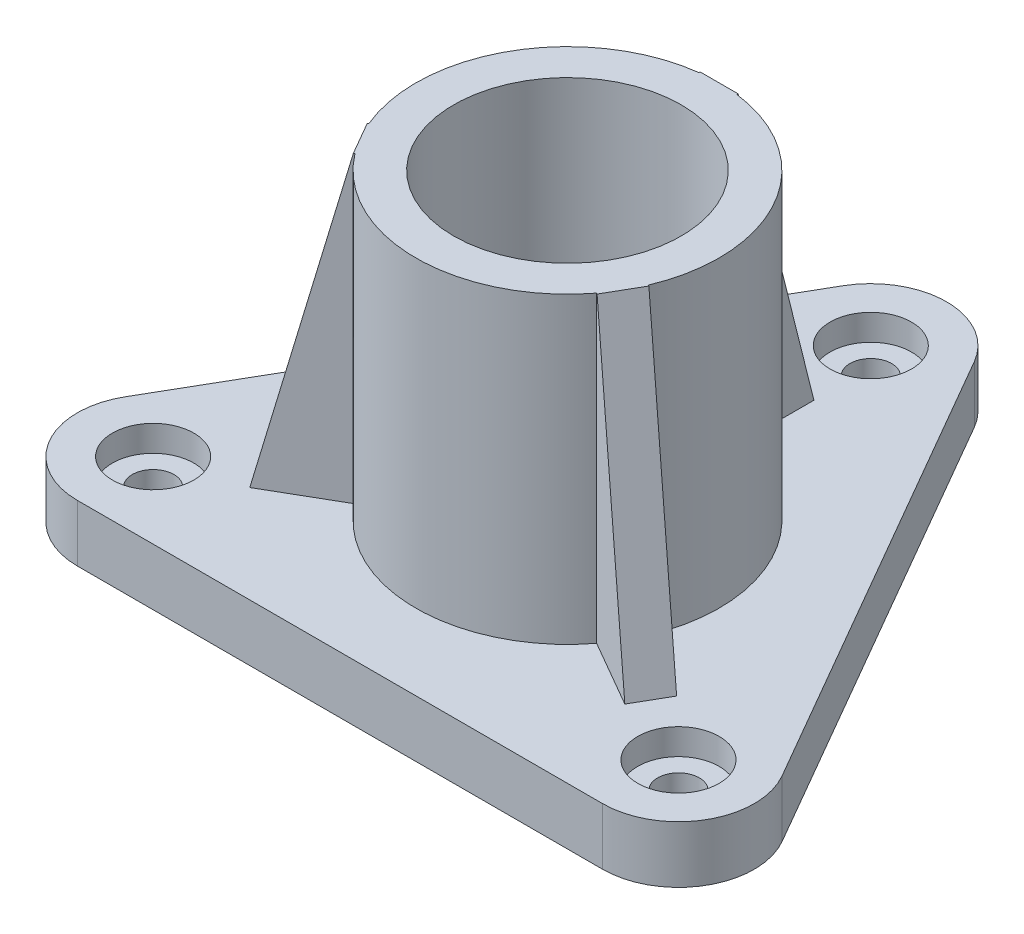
ISO-10303-21;
HEADER;
FILE_DESCRIPTION(('STEP AP214'),'2;1');
FILE_NAME('part.step','',(''),(''),'','','');
FILE_SCHEMA(('AUTOMOTIVE_DESIGN { 1 0 10303 214 1 1 1 1 }'));
ENDSEC;
DATA;
#1=APPLICATION_CONTEXT('core data for automotive mechanical design processes');
#2=APPLICATION_PROTOCOL_DEFINITION('international standard','automotive_design',2000,#1);
#3=PRODUCT_CONTEXT('',#1,'mechanical');
#4=PRODUCT('Part','Part','',(#3));
#5=PRODUCT_RELATED_PRODUCT_CATEGORY('part','',(#4));
#6=PRODUCT_DEFINITION_FORMATION('','',#4);
#7=PRODUCT_DEFINITION_CONTEXT('part definition',#1,'design');
#8=PRODUCT_DEFINITION('design','',#6,#7);
#9=PRODUCT_DEFINITION_SHAPE('','',#8);
#10=(LENGTH_UNIT() NAMED_UNIT(*) SI_UNIT(.MILLI.,.METRE.));
#11=(NAMED_UNIT(*) PLANE_ANGLE_UNIT() SI_UNIT($,.RADIAN.));
#12=(NAMED_UNIT(*) SI_UNIT($,.STERADIAN.) SOLID_ANGLE_UNIT());
#13=UNCERTAINTY_MEASURE_WITH_UNIT(LENGTH_MEASURE(1.E-05),#10,'distance_accuracy_value','');
#14=(GEOMETRIC_REPRESENTATION_CONTEXT(3) GLOBAL_UNCERTAINTY_ASSIGNED_CONTEXT((#13)) GLOBAL_UNIT_ASSIGNED_CONTEXT((#10,
#11,#12)) REPRESENTATION_CONTEXT('',''));
#15=CARTESIAN_POINT('',(0.,0.,0.));
#16=DIRECTION('',(0.,0.,1.));
#17=DIRECTION('',(1.,0.,0.));
#18=AXIS2_PLACEMENT_3D('',#15,#16,#17);
#19=CARTESIAN_POINT('',(0.,95.,0.));
#20=DIRECTION('',(0.,-1.,0.));
#21=DIRECTION('',(0.,0.,-1.));
#22=AXIS2_PLACEMENT_3D('',#19,#20,#21);
#23=CYLINDRICAL_SURFACE('',#22,40.);
#24=DIRECTION('',(0.,-1.,0.));
#25=VECTOR('',#24,1.);
#26=CARTESIAN_POINT('',(-31.869317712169,95.,24.1732618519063));
#27=LINE('',#26,#25);
#28=CARTESIAN_POINT('',(-31.869317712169,15.,24.1732618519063));
#29=VERTEX_POINT('',#28);
#30=CARTESIAN_POINT('',(-31.869317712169,95.,24.1732618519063));
#31=VERTEX_POINT('',#30);
#32=EDGE_CURVE('E41',#29,#31,#27,.F.);
#33=ORIENTED_EDGE('',*,*,#32,.F.);
#34=CARTESIAN_POINT('',(0.,15.,0.));
#35=DIRECTION('',(0.,-1.,0.));
#36=DIRECTION('',(0.,0.,-1.));
#37=AXIS2_PLACEMENT_3D('',#34,#35,#36);
#38=CIRCLE('',#37,40.);
#39=CARTESIAN_POINT('',(31.8693177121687,15.,24.1732618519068));
#40=VERTEX_POINT('',#39);
#41=EDGE_CURVE('E322',#29,#40,#38,.F.);
#42=ORIENTED_EDGE('',*,*,#41,.T.);
#43=DIRECTION('',(0.,-1.,0.));
#44=VECTOR('',#43,1.);
#45=CARTESIAN_POINT('',(31.8693177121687,95.,24.1732618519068));
#46=LINE('',#45,#44);
#47=CARTESIAN_POINT('',(31.8693177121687,95.,24.1732618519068));
#48=VERTEX_POINT('',#47);
#49=EDGE_CURVE('E331',#40,#48,#46,.F.);
#50=ORIENTED_EDGE('',*,*,#49,.T.);
#51=CARTESIAN_POINT('',(0.,95.,0.));
#52=DIRECTION('',(0.,1.,0.));
#53=DIRECTION('',(0.,0.,1.));
#54=AXIS2_PLACEMENT_3D('',#51,#52,#53);
#55=CIRCLE('',#54,40.);
#56=EDGE_CURVE('E270',#31,#48,#55,.T.);
#57=ORIENTED_EDGE('',*,*,#56,.F.);
#58=EDGE_LOOP('',(#33,#42,#50,#57));
#59=FACE_BOUND('',#58,.T.);
#60=ADVANCED_FACE('F33',(#59),#23,.T.);
#61=DIRECTION('',(0.,-1.,0.));
#62=VECTOR('',#61,1.);
#63=CARTESIAN_POINT('',(36.8693177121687,95.,15.5130078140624));
#64=LINE('',#63,#62);
#65=CARTESIAN_POINT('',(36.8693177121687,15.,15.5130078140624));
#66=VERTEX_POINT('',#65);
#67=CARTESIAN_POINT('',(36.8693177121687,95.,15.5130078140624));
#68=VERTEX_POINT('',#67);
#69=EDGE_CURVE('E328',#66,#68,#64,.F.);
#70=ORIENTED_EDGE('',*,*,#69,.F.);
#71=CARTESIAN_POINT('',(5.,15.,-39.6862696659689));
#72=VERTEX_POINT('',#71);
#73=EDGE_CURVE('E317',#66,#72,#38,.F.);
#74=ORIENTED_EDGE('',*,*,#73,.T.);
#75=DIRECTION('',(0.,-1.,0.));
#76=VECTOR('',#75,1.);
#77=CARTESIAN_POINT('',(5.,95.,-39.6862696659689));
#78=LINE('',#77,#76);
#79=CARTESIAN_POINT('',(5.,95.,-39.6862696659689));
#80=VERTEX_POINT('',#79);
#81=EDGE_CURVE('E325',#72,#80,#78,.F.);
#82=ORIENTED_EDGE('',*,*,#81,.T.);
#83=EDGE_CURVE('E266',#68,#80,#55,.T.);
#84=ORIENTED_EDGE('',*,*,#83,.F.);
#85=EDGE_LOOP('',(#70,#74,#82,#84));
#86=FACE_BOUND('',#85,.T.);
#87=ADVANCED_FACE('F344',(#86),#23,.T.);
#88=CARTESIAN_POINT('',(-69.2820323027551,15.,40.));
#89=DIRECTION('',(0.,-1.,0.));
#90=DIRECTION('',(0.,0.,-1.));
#91=AXIS2_PLACEMENT_3D('',#88,#89,#90);
#92=PLANE('',#91);
#93=CARTESIAN_POINT('',(-69.2820323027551,15.,40.));
#94=DIRECTION('',(0.,1.,0.));
#95=DIRECTION('',(0.,0.,1.));
#96=AXIS2_PLACEMENT_3D('',#93,#94,#95);
#97=CIRCLE('',#96,10.74);
#98=CARTESIAN_POINT('',(-69.2820323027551,15.,50.74));
#99=VERTEX_POINT('',#98);
#100=EDGE_CURVE('E227',#99,#99,#97,.T.);
#101=ORIENTED_EDGE('',*,*,#100,.F.);
#102=EDGE_LOOP('',(#101));
#103=FACE_BOUND('',#102,.T.);
#104=CARTESIAN_POINT('',(0.,15.,-80.));
#105=DIRECTION('',(0.,1.,0.));
#106=DIRECTION('',(0.,0.,1.));
#107=AXIS2_PLACEMENT_3D('',#104,#105,#106);
#108=CIRCLE('',#107,10.74);
#109=CARTESIAN_POINT('',(0.,15.,-69.26));
#110=VERTEX_POINT('',#109);
#111=EDGE_CURVE('E239',#110,#110,#108,.T.);
#112=ORIENTED_EDGE('',*,*,#111,.F.);
#113=EDGE_LOOP('',(#112));
#114=FACE_BOUND('',#113,.T.);
#115=CARTESIAN_POINT('',(69.2820323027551,15.,40.));
#116=DIRECTION('',(0.,1.,0.));
#117=DIRECTION('',(0.,0.,1.));
#118=AXIS2_PLACEMENT_3D('',#115,#116,#117);
#119=CIRCLE('',#118,10.74);
#120=CARTESIAN_POINT('',(69.2820323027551,15.,50.74));
#121=VERTEX_POINT('',#120);
#122=EDGE_CURVE('E251',#121,#121,#119,.T.);
#123=ORIENTED_EDGE('',*,*,#122,.F.);
#124=EDGE_LOOP('',(#123));
#125=FACE_BOUND('',#124,.T.);
#126=CARTESIAN_POINT('',(-69.2820323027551,15.,40.));
#127=DIRECTION('',(0.,1.,0.));
#128=DIRECTION('',(0.,0.,-1.));
#129=AXIS2_PLACEMENT_3D('',#126,#127,#128);
#130=CIRCLE('',#129,20.);
#131=CARTESIAN_POINT('',(-86.6025403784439,15.,30.));
#132=VERTEX_POINT('',#131);
#133=CARTESIAN_POINT('',(-69.2820323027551,15.,60.0000000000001));
#134=VERTEX_POINT('',#133);
#135=EDGE_CURVE('E286',#132,#134,#130,.T.);
#136=ORIENTED_EDGE('',*,*,#135,.T.);
#137=DIRECTION('',(1.,0.,0.));
#138=VECTOR('',#137,1.);
#139=CARTESIAN_POINT('',(-69.2820323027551,15.,60.0000000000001));
#140=LINE('',#139,#138);
#141=CARTESIAN_POINT('',(69.2820323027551,15.,60.));
#142=VERTEX_POINT('',#141);
#143=EDGE_CURVE('E289',#134,#142,#140,.T.);
#144=ORIENTED_EDGE('',*,*,#143,.T.);
#145=CARTESIAN_POINT('',(69.2820323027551,15.,40.));
#146=DIRECTION('',(0.,1.,0.));
#147=DIRECTION('',(0.,0.,-1.));
#148=AXIS2_PLACEMENT_3D('',#145,#146,#147);
#149=CIRCLE('',#148,20.);
#150=CARTESIAN_POINT('',(86.6025403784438,15.,30.));
#151=VERTEX_POINT('',#150);
#152=EDGE_CURVE('E291',#142,#151,#149,.T.);
#153=ORIENTED_EDGE('',*,*,#152,.T.);
#154=DIRECTION('',(-0.5,0.,-0.866025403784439));
#155=VECTOR('',#154,1.);
#156=CARTESIAN_POINT('',(86.6025403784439,15.,30.));
#157=LINE('',#156,#155);
#158=CARTESIAN_POINT('',(17.3205080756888,15.,-90.));
#159=VERTEX_POINT('',#158);
#160=EDGE_CURVE('E293',#151,#159,#157,.T.);
#161=ORIENTED_EDGE('',*,*,#160,.T.);
#162=CARTESIAN_POINT('',(0.,15.,-80.));
#163=DIRECTION('',(0.,1.,0.));
#164=DIRECTION('',(0.,0.,1.));
#165=AXIS2_PLACEMENT_3D('',#162,#163,#164);
#166=CIRCLE('',#165,20.);
#167=CARTESIAN_POINT('',(-17.3205080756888,15.,-90.));
#168=VERTEX_POINT('',#167);
#169=EDGE_CURVE('E295',#159,#168,#166,.T.);
#170=ORIENTED_EDGE('',*,*,#169,.T.);
#171=DIRECTION('',(-0.5,0.,0.866025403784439));
#172=VECTOR('',#171,1.);
#173=CARTESIAN_POINT('',(-17.3205080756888,15.,-90.));
#174=LINE('',#173,#172);
#175=EDGE_CURVE('E297',#168,#132,#174,.T.);
#176=ORIENTED_EDGE('',*,*,#175,.T.);
#177=EDGE_LOOP('',(#136,#144,#153,#161,#170,#176));
#178=FACE_BOUND('',#177,.T.);
#179=DIRECTION('',(0.499999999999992,0.,0.866025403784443));
#180=VECTOR('',#179,1.);
#181=CARTESIAN_POINT('',(-54.4615242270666,15.,25.6698729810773));
#182=LINE('',#181,#180);
#183=CARTESIAN_POINT('',(-54.4615242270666,15.,25.6698729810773));
#184=VERTEX_POINT('',#183);
#185=CARTESIAN_POINT('',(-49.4615242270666,15.,34.3301270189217));
#186=VERTEX_POINT('',#185);
#187=EDGE_CURVE('E48',#184,#186,#182,.T.);
#188=ORIENTED_EDGE('',*,*,#187,.F.);
#189=DIRECTION('',(-0.866025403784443,0.,0.499999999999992));
#190=VECTOR('',#189,1.);
#191=CARTESIAN_POINT('',(-28.4807621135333,15.,10.6698729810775));
#192=LINE('',#191,#190);
#193=CARTESIAN_POINT('',(-36.869317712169,15.,15.5130078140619));
#194=VERTEX_POINT('',#193);
#195=EDGE_CURVE('E180',#194,#184,#192,.T.);
#196=ORIENTED_EDGE('',*,*,#195,.F.);
#197=CARTESIAN_POINT('',(-5.,15.,-39.6862696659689));
#198=VERTEX_POINT('',#197);
#199=EDGE_CURVE('E318',#198,#194,#38,.F.);
#200=ORIENTED_EDGE('',*,*,#199,.F.);
#201=DIRECTION('',(0.,0.,-1.));
#202=VECTOR('',#201,1.);
#203=CARTESIAN_POINT('',(-5.,15.,-30.));
#204=LINE('',#203,#202);
#205=CARTESIAN_POINT('',(-5.,15.,-60.));
#206=VERTEX_POINT('',#205);
#207=EDGE_CURVE('E209',#198,#206,#204,.T.);
#208=ORIENTED_EDGE('',*,*,#207,.T.);
#209=DIRECTION('',(-1.,0.,0.));
#210=VECTOR('',#209,1.);
#211=CARTESIAN_POINT('',(5.,15.,-60.));
#212=LINE('',#211,#210);
#213=CARTESIAN_POINT('',(5.,15.,-60.));
#214=VERTEX_POINT('',#213);
#215=EDGE_CURVE('E224',#214,#206,#212,.T.);
#216=ORIENTED_EDGE('',*,*,#215,.F.);
#217=DIRECTION('',(0.,0.,-1.));
#218=VECTOR('',#217,1.);
#219=CARTESIAN_POINT('',(5.,15.,-30.));
#220=LINE('',#219,#218);
#221=EDGE_CURVE('E217',#72,#214,#220,.T.);
#222=ORIENTED_EDGE('',*,*,#221,.F.);
#223=ORIENTED_EDGE('',*,*,#73,.F.);
#224=DIRECTION('',(0.866025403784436,0.,0.500000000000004));
#225=VECTOR('',#224,1.);
#226=CARTESIAN_POINT('',(28.4807621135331,15.,10.6698729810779));
#227=LINE('',#226,#225);
#228=CARTESIAN_POINT('',(54.4615242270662,15.,25.6698729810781));
#229=VERTEX_POINT('',#228);
#230=EDGE_CURVE('E187',#66,#229,#227,.T.);
#231=ORIENTED_EDGE('',*,*,#230,.T.);
#232=DIRECTION('',(0.500000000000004,0.,-0.866025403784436));
#233=VECTOR('',#232,1.);
#234=CARTESIAN_POINT('',(49.4615242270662,15.,34.3301270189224));
#235=LINE('',#234,#233);
#236=CARTESIAN_POINT('',(49.4615242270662,15.,34.3301270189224));
#237=VERTEX_POINT('',#236);
#238=EDGE_CURVE('E203',#237,#229,#235,.T.);
#239=ORIENTED_EDGE('',*,*,#238,.F.);
#240=DIRECTION('',(0.866025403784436,0.,0.500000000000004));
#241=VECTOR('',#240,1.);
#242=CARTESIAN_POINT('',(23.4807621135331,15.,19.3301270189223));
#243=LINE('',#242,#241);
#244=EDGE_CURVE('E195',#40,#237,#243,.T.);
#245=ORIENTED_EDGE('',*,*,#244,.F.);
#246=ORIENTED_EDGE('',*,*,#41,.F.);
#247=DIRECTION('',(-0.866025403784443,0.,0.499999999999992));
#248=VECTOR('',#247,1.);
#249=CARTESIAN_POINT('',(-23.4807621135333,15.,19.330127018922));
#250=LINE('',#249,#248);
#251=EDGE_CURVE('E53',#29,#186,#250,.T.);
#252=ORIENTED_EDGE('',*,*,#251,.T.);
#253=EDGE_LOOP('',(#188,#196,#200,#208,#216,#222,#223,#231,#239,#245,#246,#252));
#254=FACE_BOUND('',#253,.T.);
#255=ADVANCED_FACE('F362',(#103,#114,#125,#178,#254),#92,.F.);
#256=CARTESIAN_POINT('',(-69.2820323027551,0.,40.));
#257=DIRECTION('',(0.,-1.,0.));
#258=DIRECTION('',(0.,0.,-1.));
#259=AXIS2_PLACEMENT_3D('',#256,#257,#258);
#260=PLANE('',#259);
#261=CARTESIAN_POINT('',(-69.2820323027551,0.,40.));
#262=DIRECTION('',(0.,1.,0.));
#263=DIRECTION('',(0.,0.,1.));
#264=AXIS2_PLACEMENT_3D('',#261,#262,#263);
#265=CIRCLE('',#264,5.49999999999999);
#266=CARTESIAN_POINT('',(-69.2820323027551,0.,45.5));
#267=VERTEX_POINT('',#266);
#268=EDGE_CURVE('E236',#267,#267,#265,.T.);
#269=ORIENTED_EDGE('',*,*,#268,.T.);
#270=EDGE_LOOP('',(#269));
#271=FACE_BOUND('',#270,.T.);
#272=CARTESIAN_POINT('',(0.,0.,-80.));
#273=DIRECTION('',(0.,1.,0.));
#274=DIRECTION('',(0.,0.,1.));
#275=AXIS2_PLACEMENT_3D('',#272,#273,#274);
#276=CIRCLE('',#275,5.5);
#277=CARTESIAN_POINT('',(0.,0.,-74.5));
#278=VERTEX_POINT('',#277);
#279=EDGE_CURVE('E248',#278,#278,#276,.T.);
#280=ORIENTED_EDGE('',*,*,#279,.T.);
#281=EDGE_LOOP('',(#280));
#282=FACE_BOUND('',#281,.T.);
#283=CARTESIAN_POINT('',(69.2820323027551,0.,40.));
#284=DIRECTION('',(0.,1.,0.));
#285=DIRECTION('',(0.,0.,1.));
#286=AXIS2_PLACEMENT_3D('',#283,#284,#285);
#287=CIRCLE('',#286,5.49999999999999);
#288=CARTESIAN_POINT('',(69.2820323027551,0.,45.5));
#289=VERTEX_POINT('',#288);
#290=EDGE_CURVE('E260',#289,#289,#287,.T.);
#291=ORIENTED_EDGE('',*,*,#290,.T.);
#292=EDGE_LOOP('',(#291));
#293=FACE_BOUND('',#292,.T.);
#294=CARTESIAN_POINT('',(-69.2820323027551,0.,40.));
#295=DIRECTION('',(0.,1.,0.));
#296=DIRECTION('',(0.,0.,-1.));
#297=AXIS2_PLACEMENT_3D('',#294,#295,#296);
#298=CIRCLE('',#297,20.);
#299=CARTESIAN_POINT('',(-86.6025403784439,0.,30.));
#300=VERTEX_POINT('',#299);
#301=CARTESIAN_POINT('',(-69.2820323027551,0.,60.0000000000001));
#302=VERTEX_POINT('',#301);
#303=EDGE_CURVE('E273',#300,#302,#298,.T.);
#304=ORIENTED_EDGE('',*,*,#303,.F.);
#305=DIRECTION('',(-0.5,0.,0.866025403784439));
#306=VECTOR('',#305,1.);
#307=CARTESIAN_POINT('',(-17.3205080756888,0.,-90.));
#308=LINE('',#307,#306);
#309=CARTESIAN_POINT('',(-17.3205080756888,0.,-90.));
#310=VERTEX_POINT('',#309);
#311=EDGE_CURVE('E284',#310,#300,#308,.T.);
#312=ORIENTED_EDGE('',*,*,#311,.F.);
#313=CARTESIAN_POINT('',(0.,0.,-80.));
#314=DIRECTION('',(0.,1.,0.));
#315=DIRECTION('',(0.,0.,1.));
#316=AXIS2_PLACEMENT_3D('',#313,#314,#315);
#317=CIRCLE('',#316,20.);
#318=CARTESIAN_POINT('',(17.3205080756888,0.,-90.));
#319=VERTEX_POINT('',#318);
#320=EDGE_CURVE('E282',#319,#310,#317,.T.);
#321=ORIENTED_EDGE('',*,*,#320,.F.);
#322=DIRECTION('',(-0.5,0.,-0.866025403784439));
#323=VECTOR('',#322,1.);
#324=CARTESIAN_POINT('',(86.6025403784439,0.,30.));
#325=LINE('',#324,#323);
#326=CARTESIAN_POINT('',(86.6025403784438,0.,30.));
#327=VERTEX_POINT('',#326);
#328=EDGE_CURVE('E280',#327,#319,#325,.T.);
#329=ORIENTED_EDGE('',*,*,#328,.F.);
#330=CARTESIAN_POINT('',(69.2820323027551,0.,40.));
#331=DIRECTION('',(0.,1.,0.));
#332=DIRECTION('',(0.,0.,-1.));
#333=AXIS2_PLACEMENT_3D('',#330,#331,#332);
#334=CIRCLE('',#333,20.);
#335=CARTESIAN_POINT('',(69.2820323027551,0.,60.));
#336=VERTEX_POINT('',#335);
#337=EDGE_CURVE('E278',#336,#327,#334,.T.);
#338=ORIENTED_EDGE('',*,*,#337,.F.);
#339=DIRECTION('',(1.,0.,0.));
#340=VECTOR('',#339,1.);
#341=CARTESIAN_POINT('',(-69.2820323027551,0.,60.0000000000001));
#342=LINE('',#341,#340);
#343=EDGE_CURVE('E276',#302,#336,#342,.T.);
#344=ORIENTED_EDGE('',*,*,#343,.F.);
#345=EDGE_LOOP('',(#304,#312,#321,#329,#338,#344));
#346=FACE_BOUND('',#345,.T.);
#347=CARTESIAN_POINT('',(0.,0.,0.));
#348=DIRECTION('',(0.,1.,0.));
#349=DIRECTION('',(0.,0.,1.));
#350=AXIS2_PLACEMENT_3D('',#347,#348,#349);
#351=CIRCLE('',#350,30.);
#352=CARTESIAN_POINT('',(0.,0.,30.));
#353=VERTEX_POINT('',#352);
#354=EDGE_CURVE('E269',#353,#353,#351,.T.);
#355=ORIENTED_EDGE('',*,*,#354,.T.);
#356=EDGE_LOOP('',(#355));
#357=FACE_BOUND('',#356,.T.);
#358=ADVANCED_FACE('F501',(#271,#282,#293,#346,#357),#260,.T.);
#359=CARTESIAN_POINT('',(-69.2820323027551,15.,40.));
#360=DIRECTION('',(0.,-1.,0.));
#361=DIRECTION('',(0.,0.,-1.));
#362=AXIS2_PLACEMENT_3D('',#359,#360,#361);
#363=CYLINDRICAL_SURFACE('',#362,20.);
#364=ORIENTED_EDGE('',*,*,#303,.T.);
#365=DIRECTION('',(0.,-1.,0.));
#366=VECTOR('',#365,1.);
#367=CARTESIAN_POINT('',(-69.2820323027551,15.,60.0000000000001));
#368=LINE('',#367,#366);
#369=EDGE_CURVE('E314',#134,#302,#368,.T.);
#370=ORIENTED_EDGE('',*,*,#369,.F.);
#371=ORIENTED_EDGE('',*,*,#135,.F.);
#372=DIRECTION('',(0.,-1.,0.));
#373=VECTOR('',#372,1.);
#374=CARTESIAN_POINT('',(-86.6025403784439,15.,30.));
#375=LINE('',#374,#373);
#376=EDGE_CURVE('E299',#132,#300,#375,.T.);
#377=ORIENTED_EDGE('',*,*,#376,.T.);
#378=EDGE_LOOP('',(#364,#370,#371,#377));
#379=FACE_BOUND('',#378,.T.);
#380=ADVANCED_FACE('F35',(#379),#363,.T.);
#381=CARTESIAN_POINT('',(-69.2820323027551,15.,60.0000000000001));
#382=DIRECTION('',(0.,0.,-1.));
#383=DIRECTION('',(-1.,0.,0.));
#384=AXIS2_PLACEMENT_3D('',#381,#382,#383);
#385=PLANE('',#384);
#386=ORIENTED_EDGE('',*,*,#343,.T.);
#387=DIRECTION('',(0.,-1.,0.));
#388=VECTOR('',#387,1.);
#389=CARTESIAN_POINT('',(69.2820323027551,15.,60.));
#390=LINE('',#389,#388);
#391=EDGE_CURVE('E311',#142,#336,#390,.T.);
#392=ORIENTED_EDGE('',*,*,#391,.F.);
#393=ORIENTED_EDGE('',*,*,#143,.F.);
#394=ORIENTED_EDGE('',*,*,#369,.T.);
#395=EDGE_LOOP('',(#386,#392,#393,#394));
#396=FACE_BOUND('',#395,.T.);
#397=ADVANCED_FACE('F631',(#396),#385,.F.);
#398=CARTESIAN_POINT('',(69.2820323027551,15.,40.));
#399=DIRECTION('',(0.,-1.,0.));
#400=DIRECTION('',(0.,0.,-1.));
#401=AXIS2_PLACEMENT_3D('',#398,#399,#400);
#402=CYLINDRICAL_SURFACE('',#401,20.);
#403=ORIENTED_EDGE('',*,*,#337,.T.);
#404=DIRECTION('',(0.,-1.,0.));
#405=VECTOR('',#404,1.);
#406=CARTESIAN_POINT('',(86.6025403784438,15.,30.));
#407=LINE('',#406,#405);
#408=EDGE_CURVE('E308',#151,#327,#407,.T.);
#409=ORIENTED_EDGE('',*,*,#408,.F.);
#410=ORIENTED_EDGE('',*,*,#152,.F.);
#411=ORIENTED_EDGE('',*,*,#391,.T.);
#412=EDGE_LOOP('',(#403,#409,#410,#411));
#413=FACE_BOUND('',#412,.T.);
#414=ADVANCED_FACE('F621',(#413),#402,.T.);
#415=CARTESIAN_POINT('',(86.6025403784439,15.,30.));
#416=DIRECTION('',(-0.866025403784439,0.,0.5));
#417=DIRECTION('',(0.5,0.,0.866025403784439));
#418=AXIS2_PLACEMENT_3D('',#415,#416,#417);
#419=PLANE('',#418);
#420=ORIENTED_EDGE('',*,*,#328,.T.);
#421=DIRECTION('',(0.,-1.,0.));
#422=VECTOR('',#421,1.);
#423=CARTESIAN_POINT('',(17.3205080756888,15.,-90.));
#424=LINE('',#423,#422);
#425=EDGE_CURVE('E305',#159,#319,#424,.T.);
#426=ORIENTED_EDGE('',*,*,#425,.F.);
#427=ORIENTED_EDGE('',*,*,#160,.F.);
#428=ORIENTED_EDGE('',*,*,#408,.T.);
#429=EDGE_LOOP('',(#420,#426,#427,#428));
#430=FACE_BOUND('',#429,.T.);
#431=ADVANCED_FACE('F611',(#430),#419,.F.);
#432=CARTESIAN_POINT('',(0.,15.,-80.));
#433=DIRECTION('',(0.,-1.,0.));
#434=DIRECTION('',(0.,0.,-1.));
#435=AXIS2_PLACEMENT_3D('',#432,#433,#434);
#436=CYLINDRICAL_SURFACE('',#435,20.);
#437=ORIENTED_EDGE('',*,*,#320,.T.);
#438=DIRECTION('',(0.,-1.,0.));
#439=VECTOR('',#438,1.);
#440=CARTESIAN_POINT('',(-17.3205080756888,15.,-90.));
#441=LINE('',#440,#439);
#442=EDGE_CURVE('E302',#168,#310,#441,.T.);
#443=ORIENTED_EDGE('',*,*,#442,.F.);
#444=ORIENTED_EDGE('',*,*,#169,.F.);
#445=ORIENTED_EDGE('',*,*,#425,.T.);
#446=EDGE_LOOP('',(#437,#443,#444,#445));
#447=FACE_BOUND('',#446,.T.);
#448=ADVANCED_FACE('F601',(#447),#436,.T.);
#449=CARTESIAN_POINT('',(-17.3205080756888,15.,-90.));
#450=DIRECTION('',(0.866025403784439,0.,0.5));
#451=DIRECTION('',(0.5,0.,-0.866025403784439));
#452=AXIS2_PLACEMENT_3D('',#449,#450,#451);
#453=PLANE('',#452);
#454=ORIENTED_EDGE('',*,*,#311,.T.);
#455=ORIENTED_EDGE('',*,*,#376,.F.);
#456=ORIENTED_EDGE('',*,*,#175,.F.);
#457=ORIENTED_EDGE('',*,*,#442,.T.);
#458=EDGE_LOOP('',(#454,#455,#456,#457));
#459=FACE_BOUND('',#458,.T.);
#460=ADVANCED_FACE('F398',(#459),#453,.F.);
#461=CARTESIAN_POINT('',(0.,15.,0.));
#462=DIRECTION('',(0.,-1.,0.));
#463=DIRECTION('',(0.,0.,-1.));
#464=AXIS2_PLACEMENT_3D('',#461,#462,#463);
#465=CYLINDRICAL_SURFACE('',#464,30.);
#466=ORIENTED_EDGE('',*,*,#354,.F.);
#467=EDGE_LOOP('',(#466));
#468=FACE_BOUND('',#467,.T.);
#469=CARTESIAN_POINT('',(0.,95.,0.));
#470=DIRECTION('',(0.,1.,0.));
#471=DIRECTION('',(0.,0.,1.));
#472=AXIS2_PLACEMENT_3D('',#469,#470,#471);
#473=CIRCLE('',#472,30.);
#474=CARTESIAN_POINT('',(0.,95.,30.));
#475=VERTEX_POINT('',#474);
#476=EDGE_CURVE('E263',#475,#475,#473,.T.);
#477=ORIENTED_EDGE('',*,*,#476,.T.);
#478=EDGE_LOOP('',(#477));
#479=FACE_BOUND('',#478,.T.);
#480=ADVANCED_FACE('F393',(#468,#479),#465,.F.);
#481=CARTESIAN_POINT('',(0.,95.,0.));
#482=DIRECTION('',(0.,1.,0.));
#483=DIRECTION('',(0.,0.,1.));
#484=AXIS2_PLACEMENT_3D('',#481,#482,#483);
#485=PLANE('',#484);
#486=ORIENTED_EDGE('',*,*,#476,.F.);
#487=EDGE_LOOP('',(#486));
#488=FACE_BOUND('',#487,.T.);
#489=CARTESIAN_POINT('',(-5.,95.,-39.6862696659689));
#490=VERTEX_POINT('',#489);
#491=CARTESIAN_POINT('',(-36.869317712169,95.,15.5130078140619));
#492=VERTEX_POINT('',#491);
#493=EDGE_CURVE('E267',#490,#492,#55,.T.);
#494=ORIENTED_EDGE('',*,*,#493,.T.);
#495=DIRECTION('',(0.866025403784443,0.,-0.499999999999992));
#496=VECTOR('',#495,1.);
#497=CARTESIAN_POINT('',(-37.1410161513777,95.,15.6698729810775));
#498=LINE('',#497,#496);
#499=CARTESIAN_POINT('',(-37.1410161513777,95.,15.6698729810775));
#500=VERTEX_POINT('',#499);
#501=EDGE_CURVE('E163',#500,#492,#498,.T.);
#502=ORIENTED_EDGE('',*,*,#501,.F.);
#503=DIRECTION('',(0.499999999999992,0.,0.866025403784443));
#504=VECTOR('',#503,1.);
#505=CARTESIAN_POINT('',(-37.1410161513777,95.,15.6698729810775));
#506=LINE('',#505,#504);
#507=CARTESIAN_POINT('',(-32.1410161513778,95.,24.3301270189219));
#508=VERTEX_POINT('',#507);
#509=EDGE_CURVE('E156',#500,#508,#506,.T.);
#510=ORIENTED_EDGE('',*,*,#509,.T.);
#511=DIRECTION('',(0.866025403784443,0.,-0.499999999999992));
#512=VECTOR('',#511,1.);
#513=CARTESIAN_POINT('',(-32.1410161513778,95.,24.3301270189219));
#514=LINE('',#513,#512);
#515=EDGE_CURVE('E161',#508,#31,#514,.T.);
#516=ORIENTED_EDGE('',*,*,#515,.T.);
#517=ORIENTED_EDGE('',*,*,#56,.T.);
#518=DIRECTION('',(-0.866025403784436,0.,-0.500000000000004));
#519=VECTOR('',#518,1.);
#520=CARTESIAN_POINT('',(32.1410161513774,95.,24.3301270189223));
#521=LINE('',#520,#519);
#522=CARTESIAN_POINT('',(32.1410161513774,95.,24.3301270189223));
#523=VERTEX_POINT('',#522);
#524=EDGE_CURVE('E192',#523,#48,#521,.T.);
#525=ORIENTED_EDGE('',*,*,#524,.F.);
#526=DIRECTION('',(0.500000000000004,0.,-0.866025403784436));
#527=VECTOR('',#526,1.);
#528=CARTESIAN_POINT('',(32.1410161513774,95.,24.3301270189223));
#529=LINE('',#528,#527);
#530=CARTESIAN_POINT('',(37.1410161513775,95.,15.669872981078));
#531=VERTEX_POINT('',#530);
#532=EDGE_CURVE('E201',#523,#531,#529,.T.);
#533=ORIENTED_EDGE('',*,*,#532,.T.);
#534=DIRECTION('',(-0.866025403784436,0.,-0.500000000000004));
#535=VECTOR('',#534,1.);
#536=CARTESIAN_POINT('',(37.1410161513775,95.,15.669872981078));
#537=LINE('',#536,#535);
#538=EDGE_CURVE('E184',#531,#68,#537,.T.);
#539=ORIENTED_EDGE('',*,*,#538,.T.);
#540=ORIENTED_EDGE('',*,*,#83,.T.);
#541=DIRECTION('',(0.,0.,1.));
#542=VECTOR('',#541,1.);
#543=CARTESIAN_POINT('',(5.,95.,-40.));
#544=LINE('',#543,#542);
#545=CARTESIAN_POINT('',(5.,95.,-40.));
#546=VERTEX_POINT('',#545);
#547=EDGE_CURVE('E214',#546,#80,#544,.T.);
#548=ORIENTED_EDGE('',*,*,#547,.F.);
#549=DIRECTION('',(-1.,0.,0.));
#550=VECTOR('',#549,1.);
#551=CARTESIAN_POINT('',(5.,95.,-40.));
#552=LINE('',#551,#550);
#553=CARTESIAN_POINT('',(-5.,95.,-40.));
#554=VERTEX_POINT('',#553);
#555=EDGE_CURVE('E222',#546,#554,#552,.T.);
#556=ORIENTED_EDGE('',*,*,#555,.T.);
#557=DIRECTION('',(0.,0.,1.));
#558=VECTOR('',#557,1.);
#559=CARTESIAN_POINT('',(-5.,95.,-40.));
#560=LINE('',#559,#558);
#561=EDGE_CURVE('E206',#554,#490,#560,.T.);
#562=ORIENTED_EDGE('',*,*,#561,.T.);
#563=EDGE_LOOP('',(#494,#502,#510,#516,#517,#525,#533,#539,#540,#548,#556,#562));
#564=FACE_BOUND('',#563,.T.);
#565=ADVANCED_FACE('F159',(#488,#564),#485,.T.);
#566=ORIENTED_EDGE('',*,*,#199,.T.);
#567=DIRECTION('',(0.,-1.,0.));
#568=VECTOR('',#567,1.);
#569=CARTESIAN_POINT('',(-36.869317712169,95.,15.5130078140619));
#570=LINE('',#569,#568);
#571=EDGE_CURVE('E11',#194,#492,#570,.F.);
#572=ORIENTED_EDGE('',*,*,#571,.T.);
#573=ORIENTED_EDGE('',*,*,#493,.F.);
#574=DIRECTION('',(0.,-1.,0.));
#575=VECTOR('',#574,1.);
#576=CARTESIAN_POINT('',(-5.,95.,-39.6862696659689));
#577=LINE('',#576,#575);
#578=EDGE_CURVE('E321',#198,#490,#577,.F.);
#579=ORIENTED_EDGE('',*,*,#578,.F.);
#580=EDGE_LOOP('',(#566,#572,#573,#579));
#581=FACE_BOUND('',#580,.T.);
#582=ADVANCED_FACE('F360',(#581),#23,.T.);
#583=CARTESIAN_POINT('',(69.2820323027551,15.,40.));
#584=DIRECTION('',(0.,1.,0.));
#585=DIRECTION('',(0.,0.,1.));
#586=AXIS2_PLACEMENT_3D('',#583,#584,#585);
#587=CYLINDRICAL_SURFACE('',#586,5.5);
#588=ORIENTED_EDGE('',*,*,#290,.F.);
#589=EDGE_LOOP('',(#588));
#590=FACE_BOUND('',#589,.T.);
#591=CARTESIAN_POINT('',(69.2820323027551,8.15,40.));
#592=DIRECTION('',(0.,1.,0.));
#593=DIRECTION('',(0.,0.,1.));
#594=AXIS2_PLACEMENT_3D('',#591,#592,#593);
#595=CIRCLE('',#594,5.50000000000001);
#596=CARTESIAN_POINT('',(69.2820323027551,8.15,45.5));
#597=VERTEX_POINT('',#596);
#598=EDGE_CURVE('E257',#597,#597,#595,.T.);
#599=ORIENTED_EDGE('',*,*,#598,.T.);
#600=EDGE_LOOP('',(#599));
#601=FACE_BOUND('',#600,.T.);
#602=ADVANCED_FACE('F385',(#590,#601),#587,.F.);
#603=CARTESIAN_POINT('',(74.7820323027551,8.15,40.));
#604=DIRECTION('',(0.,-1.,0.));
#605=DIRECTION('',(0.,0.,-1.));
#606=AXIS2_PLACEMENT_3D('',#603,#604,#605);
#607=PLANE('',#606);
#608=ORIENTED_EDGE('',*,*,#598,.F.);
#609=EDGE_LOOP('',(#608));
#610=FACE_BOUND('',#609,.T.);
#611=CARTESIAN_POINT('',(69.2820323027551,8.15,40.));
#612=DIRECTION('',(0.,1.,0.));
#613=DIRECTION('',(0.,0.,1.));
#614=AXIS2_PLACEMENT_3D('',#611,#612,#613);
#615=CIRCLE('',#614,10.74);
#616=CARTESIAN_POINT('',(69.2820323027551,8.15,50.74));
#617=VERTEX_POINT('',#616);
#618=EDGE_CURVE('E254',#617,#617,#615,.T.);
#619=ORIENTED_EDGE('',*,*,#618,.T.);
#620=EDGE_LOOP('',(#619));
#621=FACE_BOUND('',#620,.T.);
#622=ADVANCED_FACE('F390',(#610,#621),#607,.F.);
#623=CARTESIAN_POINT('',(69.2820323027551,15.,40.));
#624=DIRECTION('',(0.,1.,0.));
#625=DIRECTION('',(0.,0.,1.));
#626=AXIS2_PLACEMENT_3D('',#623,#624,#625);
#627=CYLINDRICAL_SURFACE('',#626,10.74);
#628=ORIENTED_EDGE('',*,*,#618,.F.);
#629=EDGE_LOOP('',(#628));
#630=FACE_BOUND('',#629,.T.);
#631=ORIENTED_EDGE('',*,*,#122,.T.);
#632=EDGE_LOOP('',(#631));
#633=FACE_BOUND('',#632,.T.);
#634=ADVANCED_FACE('F404',(#630,#633),#627,.F.);
#635=CARTESIAN_POINT('',(0.,15.,-80.));
#636=DIRECTION('',(0.,1.,0.));
#637=DIRECTION('',(0.,0.,1.));
#638=AXIS2_PLACEMENT_3D('',#635,#636,#637);
#639=CYLINDRICAL_SURFACE('',#638,5.5);
#640=ORIENTED_EDGE('',*,*,#279,.F.);
#641=EDGE_LOOP('',(#640));
#642=FACE_BOUND('',#641,.T.);
#643=CARTESIAN_POINT('',(0.,8.15,-80.));
#644=DIRECTION('',(0.,1.,0.));
#645=DIRECTION('',(0.,0.,1.));
#646=AXIS2_PLACEMENT_3D('',#643,#644,#645);
#647=CIRCLE('',#646,5.5);
#648=CARTESIAN_POINT('',(0.,8.15,-74.5));
#649=VERTEX_POINT('',#648);
#650=EDGE_CURVE('E245',#649,#649,#647,.T.);
#651=ORIENTED_EDGE('',*,*,#650,.T.);
#652=EDGE_LOOP('',(#651));
#653=FACE_BOUND('',#652,.T.);
#654=ADVANCED_FACE('F408',(#642,#653),#639,.F.);
#655=CARTESIAN_POINT('',(5.49999999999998,8.15,-80.));
#656=DIRECTION('',(0.,-1.,0.));
#657=DIRECTION('',(0.,0.,-1.));
#658=AXIS2_PLACEMENT_3D('',#655,#656,#657);
#659=PLANE('',#658);
#660=ORIENTED_EDGE('',*,*,#650,.F.);
#661=EDGE_LOOP('',(#660));
#662=FACE_BOUND('',#661,.T.);
#663=CARTESIAN_POINT('',(0.,8.15,-80.));
#664=DIRECTION('',(0.,1.,0.));
#665=DIRECTION('',(0.,0.,1.));
#666=AXIS2_PLACEMENT_3D('',#663,#664,#665);
#667=CIRCLE('',#666,10.74);
#668=CARTESIAN_POINT('',(0.,8.15,-69.26));
#669=VERTEX_POINT('',#668);
#670=EDGE_CURVE('E242',#669,#669,#667,.T.);
#671=ORIENTED_EDGE('',*,*,#670,.T.);
#672=EDGE_LOOP('',(#671));
#673=FACE_BOUND('',#672,.T.);
#674=ADVANCED_FACE('F412',(#662,#673),#659,.F.);
#675=CARTESIAN_POINT('',(0.,15.,-80.));
#676=DIRECTION('',(0.,1.,0.));
#677=DIRECTION('',(0.,0.,1.));
#678=AXIS2_PLACEMENT_3D('',#675,#676,#677);
#679=CYLINDRICAL_SURFACE('',#678,10.74);
#680=ORIENTED_EDGE('',*,*,#670,.F.);
#681=EDGE_LOOP('',(#680));
#682=FACE_BOUND('',#681,.T.);
#683=ORIENTED_EDGE('',*,*,#111,.T.);
#684=EDGE_LOOP('',(#683));
#685=FACE_BOUND('',#684,.T.);
#686=ADVANCED_FACE('F416',(#682,#685),#679,.F.);
#687=CARTESIAN_POINT('',(-69.2820323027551,15.,40.));
#688=DIRECTION('',(0.,1.,0.));
#689=DIRECTION('',(0.,0.,1.));
#690=AXIS2_PLACEMENT_3D('',#687,#688,#689);
#691=CYLINDRICAL_SURFACE('',#690,5.5);
#692=ORIENTED_EDGE('',*,*,#268,.F.);
#693=EDGE_LOOP('',(#692));
#694=FACE_BOUND('',#693,.T.);
#695=CARTESIAN_POINT('',(-69.2820323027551,8.15,40.));
#696=DIRECTION('',(0.,1.,0.));
#697=DIRECTION('',(0.,0.,1.));
#698=AXIS2_PLACEMENT_3D('',#695,#696,#697);
#699=CIRCLE('',#698,5.50000000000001);
#700=CARTESIAN_POINT('',(-69.2820323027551,8.15,45.5));
#701=VERTEX_POINT('',#700);
#702=EDGE_CURVE('E233',#701,#701,#699,.T.);
#703=ORIENTED_EDGE('',*,*,#702,.T.);
#704=EDGE_LOOP('',(#703));
#705=FACE_BOUND('',#704,.T.);
#706=ADVANCED_FACE('F420',(#694,#705),#691,.F.);
#707=CARTESIAN_POINT('',(-63.7820323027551,8.15,40.));
#708=DIRECTION('',(0.,-1.,0.));
#709=DIRECTION('',(0.,0.,-1.));
#710=AXIS2_PLACEMENT_3D('',#707,#708,#709);
#711=PLANE('',#710);
#712=ORIENTED_EDGE('',*,*,#702,.F.);
#713=EDGE_LOOP('',(#712));
#714=FACE_BOUND('',#713,.T.);
#715=CARTESIAN_POINT('',(-69.2820323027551,8.15,40.));
#716=DIRECTION('',(0.,1.,0.));
#717=DIRECTION('',(0.,0.,1.));
#718=AXIS2_PLACEMENT_3D('',#715,#716,#717);
#719=CIRCLE('',#718,10.74);
#720=CARTESIAN_POINT('',(-69.2820323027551,8.15,50.74));
#721=VERTEX_POINT('',#720);
#722=EDGE_CURVE('E230',#721,#721,#719,.T.);
#723=ORIENTED_EDGE('',*,*,#722,.T.);
#724=EDGE_LOOP('',(#723));
#725=FACE_BOUND('',#724,.T.);
#726=ADVANCED_FACE('F424',(#714,#725),#711,.F.);
#727=CARTESIAN_POINT('',(-69.2820323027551,15.,40.));
#728=DIRECTION('',(0.,1.,0.));
#729=DIRECTION('',(0.,0.,1.));
#730=AXIS2_PLACEMENT_3D('',#727,#728,#729);
#731=CYLINDRICAL_SURFACE('',#730,10.74);
#732=ORIENTED_EDGE('',*,*,#722,.F.);
#733=EDGE_LOOP('',(#732));
#734=FACE_BOUND('',#733,.T.);
#735=ORIENTED_EDGE('',*,*,#100,.T.);
#736=EDGE_LOOP('',(#735));
#737=FACE_BOUND('',#736,.T.);
#738=ADVANCED_FACE('F428',(#734,#737),#731,.F.);
#739=CARTESIAN_POINT('',(5.,95.,-30.));
#740=DIRECTION('',(1.,0.,0.));
#741=DIRECTION('',(0.,0.,-1.));
#742=AXIS2_PLACEMENT_3D('',#739,#740,#741);
#743=PLANE('',#742);
#744=ORIENTED_EDGE('',*,*,#81,.F.);
#745=ORIENTED_EDGE('',*,*,#221,.T.);
#746=DIRECTION('',(0.,0.970142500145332,0.242535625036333));
#747=VECTOR('',#746,1.);
#748=CARTESIAN_POINT('',(5.,95.,-40.));
#749=LINE('',#748,#747);
#750=EDGE_CURVE('E220',#214,#546,#749,.T.);
#751=ORIENTED_EDGE('',*,*,#750,.T.);
#752=ORIENTED_EDGE('',*,*,#547,.T.);
#753=EDGE_LOOP('',(#744,#745,#751,#752));
#754=FACE_BOUND('',#753,.T.);
#755=ADVANCED_FACE('F348',(#754),#743,.T.);
#756=CARTESIAN_POINT('',(-5.,95.,-30.));
#757=DIRECTION('',(1.,0.,0.));
#758=DIRECTION('',(0.,0.,-1.));
#759=AXIS2_PLACEMENT_3D('',#756,#757,#758);
#760=PLANE('',#759);
#761=ORIENTED_EDGE('',*,*,#207,.F.);
#762=ORIENTED_EDGE('',*,*,#578,.T.);
#763=ORIENTED_EDGE('',*,*,#561,.F.);
#764=DIRECTION('',(0.,0.970142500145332,0.242535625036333));
#765=VECTOR('',#764,1.);
#766=CARTESIAN_POINT('',(-5.,95.,-40.));
#767=LINE('',#766,#765);
#768=EDGE_CURVE('E211',#206,#554,#767,.T.);
#769=ORIENTED_EDGE('',*,*,#768,.F.);
#770=EDGE_LOOP('',(#761,#762,#763,#769));
#771=FACE_BOUND('',#770,.T.);
#772=ADVANCED_FACE('F357',(#771),#760,.F.);
#773=CARTESIAN_POINT('',(5.,95.,-40.));
#774=DIRECTION('',(0.,-0.242535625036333,0.970142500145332));
#775=DIRECTION('',(0.,-0.970142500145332,-0.242535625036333));
#776=AXIS2_PLACEMENT_3D('',#773,#774,#775);
#777=PLANE('',#776);
#778=ORIENTED_EDGE('',*,*,#768,.T.);
#779=ORIENTED_EDGE('',*,*,#555,.F.);
#780=ORIENTED_EDGE('',*,*,#750,.F.);
#781=ORIENTED_EDGE('',*,*,#215,.T.);
#782=EDGE_LOOP('',(#778,#779,#780,#781));
#783=FACE_BOUND('',#782,.T.);
#784=ADVANCED_FACE('F352',(#783),#777,.F.);
#785=CARTESIAN_POINT('',(23.4807621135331,95.,19.3301270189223));
#786=DIRECTION('',(-0.500000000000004,0.,0.866025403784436));
#787=DIRECTION('',(0.866025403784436,0.,0.500000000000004));
#788=AXIS2_PLACEMENT_3D('',#785,#786,#787);
#789=PLANE('',#788);
#790=ORIENTED_EDGE('',*,*,#49,.F.);
#791=ORIENTED_EDGE('',*,*,#244,.T.);
#792=DIRECTION('',(-0.210042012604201,0.970142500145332,-0.121267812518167));
#793=VECTOR('',#792,1.);
#794=CARTESIAN_POINT('',(32.1410161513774,95.,24.3301270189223));
#795=LINE('',#794,#793);
#796=EDGE_CURVE('E198',#237,#523,#795,.T.);
#797=ORIENTED_EDGE('',*,*,#796,.T.);
#798=ORIENTED_EDGE('',*,*,#524,.T.);
#799=EDGE_LOOP('',(#790,#791,#797,#798));
#800=FACE_BOUND('',#799,.T.);
#801=ADVANCED_FACE('F338',(#800),#789,.T.);
#802=CARTESIAN_POINT('',(28.4807621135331,95.,10.6698729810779));
#803=DIRECTION('',(-0.500000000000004,0.,0.866025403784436));
#804=DIRECTION('',(0.866025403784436,0.,0.500000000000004));
#805=AXIS2_PLACEMENT_3D('',#802,#803,#804);
#806=PLANE('',#805);
#807=ORIENTED_EDGE('',*,*,#230,.F.);
#808=ORIENTED_EDGE('',*,*,#69,.T.);
#809=ORIENTED_EDGE('',*,*,#538,.F.);
#810=DIRECTION('',(-0.210042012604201,0.970142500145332,-0.121267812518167));
#811=VECTOR('',#810,1.);
#812=CARTESIAN_POINT('',(37.1410161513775,95.,15.669872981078));
#813=LINE('',#812,#811);
#814=EDGE_CURVE('E189',#229,#531,#813,.T.);
#815=ORIENTED_EDGE('',*,*,#814,.F.);
#816=EDGE_LOOP('',(#807,#808,#809,#815));
#817=FACE_BOUND('',#816,.T.);
#818=ADVANCED_FACE('F373',(#817),#806,.F.);
#819=CARTESIAN_POINT('',(32.1410161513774,95.,24.3301270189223));
#820=DIRECTION('',(-0.840168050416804,-0.242535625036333,-0.48507125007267));
#821=DIRECTION('',(-0.500000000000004,0.,0.866025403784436));
#822=AXIS2_PLACEMENT_3D('',#819,#820,#821);
#823=PLANE('',#822);
#824=ORIENTED_EDGE('',*,*,#814,.T.);
#825=ORIENTED_EDGE('',*,*,#532,.F.);
#826=ORIENTED_EDGE('',*,*,#796,.F.);
#827=ORIENTED_EDGE('',*,*,#238,.T.);
#828=EDGE_LOOP('',(#824,#825,#826,#827));
#829=FACE_BOUND('',#828,.T.);
#830=ADVANCED_FACE('F366',(#829),#823,.F.);
#831=CARTESIAN_POINT('',(-28.4807621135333,95.,10.6698729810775));
#832=DIRECTION('',(-0.499999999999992,0.,-0.866025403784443));
#833=DIRECTION('',(-0.866025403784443,0.,0.499999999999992));
#834=AXIS2_PLACEMENT_3D('',#831,#832,#833);
#835=PLANE('',#834);
#836=ORIENTED_EDGE('',*,*,#571,.F.);
#837=ORIENTED_EDGE('',*,*,#195,.T.);
#838=DIRECTION('',(0.210042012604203,0.970142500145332,-0.121267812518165));
#839=VECTOR('',#838,1.);
#840=CARTESIAN_POINT('',(-37.1410161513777,95.,15.6698729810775));
#841=LINE('',#840,#839);
#842=EDGE_CURVE('E167',#184,#500,#841,.T.);
#843=ORIENTED_EDGE('',*,*,#842,.T.);
#844=ORIENTED_EDGE('',*,*,#501,.T.);
#845=EDGE_LOOP('',(#836,#837,#843,#844));
#846=FACE_BOUND('',#845,.T.);
#847=ADVANCED_FACE('F364',(#846),#835,.T.);
#848=CARTESIAN_POINT('',(-23.4807621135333,95.,19.330127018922));
#849=DIRECTION('',(-0.499999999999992,0.,-0.866025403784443));
#850=DIRECTION('',(-0.866025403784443,0.,0.499999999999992));
#851=AXIS2_PLACEMENT_3D('',#848,#849,#850);
#852=PLANE('',#851);
#853=ORIENTED_EDGE('',*,*,#251,.F.);
#854=ORIENTED_EDGE('',*,*,#32,.T.);
#855=ORIENTED_EDGE('',*,*,#515,.F.);
#856=DIRECTION('',(0.210042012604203,0.970142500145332,-0.121267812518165));
#857=VECTOR('',#856,1.);
#858=CARTESIAN_POINT('',(-32.1410161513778,95.,24.3301270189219));
#859=LINE('',#858,#857);
#860=EDGE_CURVE('E170',#186,#508,#859,.T.);
#861=ORIENTED_EDGE('',*,*,#860,.F.);
#862=EDGE_LOOP('',(#853,#854,#855,#861));
#863=FACE_BOUND('',#862,.T.);
#864=ADVANCED_FACE('F175',(#863),#852,.F.);
#865=CARTESIAN_POINT('',(-37.1410161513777,95.,15.6698729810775));
#866=DIRECTION('',(0.84016805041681,-0.242535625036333,-0.485071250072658));
#867=DIRECTION('',(-0.499999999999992,0.,-0.866025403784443));
#868=AXIS2_PLACEMENT_3D('',#865,#866,#867);
#869=PLANE('',#868);
#870=ORIENTED_EDGE('',*,*,#860,.T.);
#871=ORIENTED_EDGE('',*,*,#509,.F.);
#872=ORIENTED_EDGE('',*,*,#842,.F.);
#873=ORIENTED_EDGE('',*,*,#187,.T.);
#874=EDGE_LOOP('',(#870,#871,#872,#873));
#875=FACE_BOUND('',#874,.T.);
#876=ADVANCED_FACE('F171',(#875),#869,.F.);
#877=CLOSED_SHELL('',(#60,#87,#255,#358,#380,#397,#414,#431,#448,#460,#480,#565,#582,#602,#622,
#634,#654,#674,#686,#706,#726,#738,#755,#772,#784,#801,#818,#830,#847,#864,#876));
#878=MANIFOLD_SOLID_BREP('B2',#877);
#879=ADVANCED_BREP_SHAPE_REPRESENTATION('',(#18,#878),#14);
#880=SHAPE_DEFINITION_REPRESENTATION(#9,#879);
ENDSEC;
END-ISO-10303-21;
